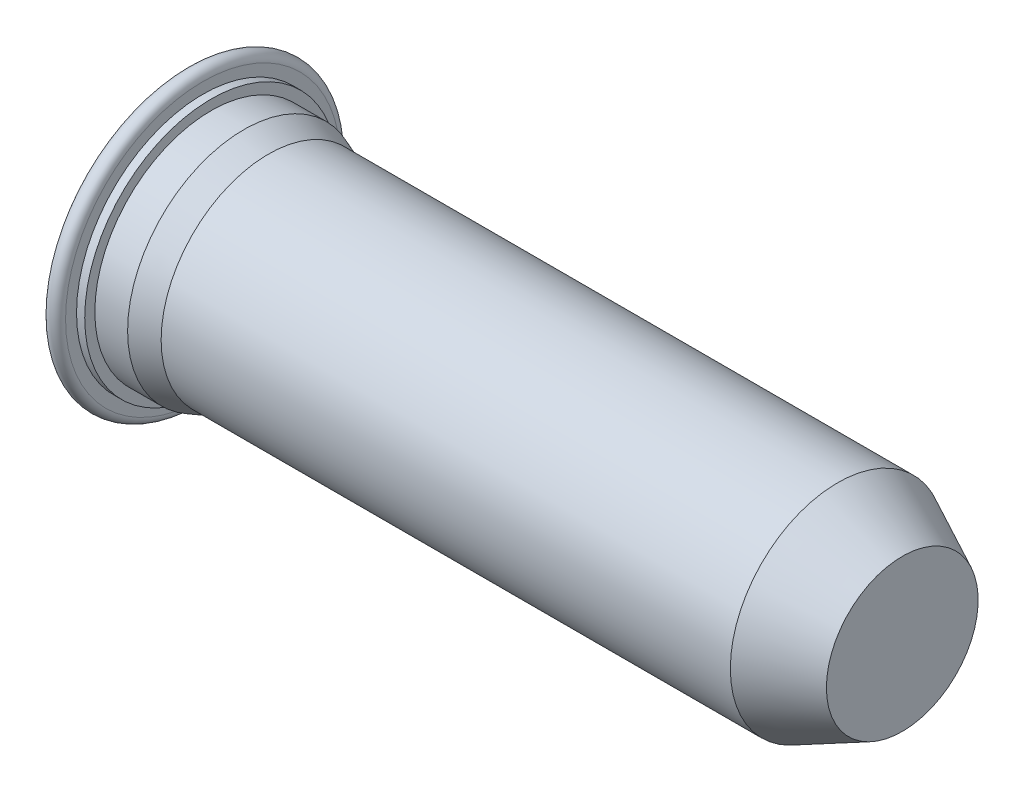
ISO-10303-21;
HEADER;
FILE_DESCRIPTION(('STEP AP214'),'2;1');
FILE_NAME('part.step','',(''),(''),'','','');
FILE_SCHEMA(('AUTOMOTIVE_DESIGN { 1 0 10303 214 1 1 1 1 }'));
ENDSEC;
DATA;
#1=APPLICATION_CONTEXT('core data for automotive mechanical design processes');
#2=APPLICATION_PROTOCOL_DEFINITION('international standard','automotive_design',2000,#1);
#3=PRODUCT_CONTEXT('',#1,'mechanical');
#4=PRODUCT('Part','Part','',(#3));
#5=PRODUCT_RELATED_PRODUCT_CATEGORY('part','',(#4));
#6=PRODUCT_DEFINITION_FORMATION('','',#4);
#7=PRODUCT_DEFINITION_CONTEXT('part definition',#1,'design');
#8=PRODUCT_DEFINITION('design','',#6,#7);
#9=PRODUCT_DEFINITION_SHAPE('','',#8);
#10=(LENGTH_UNIT() NAMED_UNIT(*) SI_UNIT(.MILLI.,.METRE.));
#11=(NAMED_UNIT(*) PLANE_ANGLE_UNIT() SI_UNIT($,.RADIAN.));
#12=(NAMED_UNIT(*) SI_UNIT($,.STERADIAN.) SOLID_ANGLE_UNIT());
#13=UNCERTAINTY_MEASURE_WITH_UNIT(LENGTH_MEASURE(1.E-05),#10,'distance_accuracy_value','');
#14=(GEOMETRIC_REPRESENTATION_CONTEXT(3) GLOBAL_UNCERTAINTY_ASSIGNED_CONTEXT((#13)) GLOBAL_UNIT_ASSIGNED_CONTEXT((#10,
#11,#12)) REPRESENTATION_CONTEXT('',''));
#15=CARTESIAN_POINT('',(0.,0.,0.));
#16=DIRECTION('',(0.,0.,1.));
#17=DIRECTION('',(1.,0.,0.));
#18=AXIS2_PLACEMENT_3D('',#15,#16,#17);
#19=CARTESIAN_POINT('',(0.,0.,0.));
#20=DIRECTION('',(-1.,0.,0.));
#21=DIRECTION('',(0.,0.,1.));
#22=AXIS2_PLACEMENT_3D('',#19,#20,#21);
#23=PLANE('',#22);
#24=CARTESIAN_POINT('',(0.,0.,0.));
#25=DIRECTION('',(-1.,0.,0.));
#26=DIRECTION('',(0.,0.,1.));
#27=AXIS2_PLACEMENT_3D('',#24,#25,#26);
#28=CIRCLE('',#27,3.83346);
#29=CARTESIAN_POINT('',(0.,0.,3.83346));
#30=VERTEX_POINT('',#29);
#31=EDGE_CURVE('E10',#30,#30,#28,.T.);
#32=ORIENTED_EDGE('',*,*,#31,.T.);
#33=EDGE_LOOP('',(#32));
#34=FACE_BOUND('',#33,.T.);
#35=ADVANCED_FACE('F40',(#34),#23,.T.);
#36=CARTESIAN_POINT('',(0.,0.,0.));
#37=DIRECTION('',(-1.,0.,0.));
#38=DIRECTION('',(0.,0.,1.));
#39=AXIS2_PLACEMENT_3D('',#36,#37,#38);
#40=CYLINDRICAL_SURFACE('',#39,3.83346);
#41=CARTESIAN_POINT('',(0.00508000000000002,0.,0.));
#42=DIRECTION('',(-1.,0.,0.));
#43=DIRECTION('',(0.,0.,1.));
#44=AXIS2_PLACEMENT_3D('',#41,#42,#43);
#45=CIRCLE('',#44,3.83346);
#46=CARTESIAN_POINT('',(0.00508000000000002,0.,3.83346));
#47=VERTEX_POINT('',#46);
#48=EDGE_CURVE('E43',#47,#47,#45,.T.);
#49=ORIENTED_EDGE('',*,*,#48,.T.);
#50=EDGE_LOOP('',(#49));
#51=FACE_BOUND('',#50,.T.);
#52=ORIENTED_EDGE('',*,*,#31,.F.);
#53=EDGE_LOOP('',(#52));
#54=FACE_BOUND('',#53,.T.);
#55=ADVANCED_FACE('F86',(#51,#54),#40,.T.);
#56=CARTESIAN_POINT('',(0.00508000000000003,3.83854,0.));
#57=DIRECTION('',(1.,0.,0.));
#58=DIRECTION('',(0.,0.,-1.));
#59=AXIS2_PLACEMENT_3D('',#56,#57,#58);
#60=PLANE('',#59);
#61=ORIENTED_EDGE('',*,*,#48,.F.);
#62=EDGE_LOOP('',(#61));
#63=FACE_BOUND('',#62,.T.);
#64=CARTESIAN_POINT('',(0.00508000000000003,0.,0.));
#65=DIRECTION('',(-1.,0.,0.));
#66=DIRECTION('',(0.,0.,1.));
#67=AXIS2_PLACEMENT_3D('',#64,#65,#66);
#68=CIRCLE('',#67,3.83854);
#69=CARTESIAN_POINT('',(0.00508000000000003,0.,3.83854));
#70=VERTEX_POINT('',#69);
#71=EDGE_CURVE('E50',#70,#70,#68,.T.);
#72=ORIENTED_EDGE('',*,*,#71,.T.);
#73=EDGE_LOOP('',(#72));
#74=FACE_BOUND('',#73,.T.);
#75=ADVANCED_FACE('F94',(#63,#74),#60,.F.);
#76=CARTESIAN_POINT('',(0.23154,0.,0.));
#77=DIRECTION('',(-1.,0.,0.));
#78=DIRECTION('',(0.,0.,1.));
#79=AXIS2_PLACEMENT_3D('',#76,#77,#78);
#80=TOROIDAL_SURFACE('',#79,3.83854,0.22646);
#81=CARTESIAN_POINT('',(0.458,0.,0.));
#82=DIRECTION('',(-1.,0.,0.));
#83=DIRECTION('',(0.,0.,1.));
#84=AXIS2_PLACEMENT_3D('',#81,#82,#83);
#85=CIRCLE('',#84,3.83854);
#86=CARTESIAN_POINT('',(0.458,0.,3.83854));
#87=VERTEX_POINT('',#86);
#88=EDGE_CURVE('E51',#87,#87,#85,.T.);
#89=ORIENTED_EDGE('',*,*,#88,.T.);
#90=EDGE_LOOP('',(#89));
#91=FACE_BOUND('',#90,.T.);
#92=ORIENTED_EDGE('',*,*,#71,.F.);
#93=EDGE_LOOP('',(#92));
#94=FACE_BOUND('',#93,.T.);
#95=ADVANCED_FACE('F96',(#91,#94),#80,.T.);
#96=CARTESIAN_POINT('',(0.458,3.83854,0.));
#97=DIRECTION('',(1.,0.,0.));
#98=DIRECTION('',(0.,0.,-1.));
#99=AXIS2_PLACEMENT_3D('',#96,#97,#98);
#100=PLANE('',#99);
#101=CARTESIAN_POINT('',(0.458,0.,0.));
#102=DIRECTION('',(-1.,0.,0.));
#103=DIRECTION('',(0.,0.,1.));
#104=AXIS2_PLACEMENT_3D('',#101,#102,#103);
#105=CIRCLE('',#104,3.5325);
#106=CARTESIAN_POINT('',(0.458,0.,3.5325));
#107=VERTEX_POINT('',#106);
#108=EDGE_CURVE('E57',#107,#107,#105,.T.);
#109=ORIENTED_EDGE('',*,*,#108,.T.);
#110=EDGE_LOOP('',(#109));
#111=FACE_BOUND('',#110,.T.);
#112=ORIENTED_EDGE('',*,*,#88,.F.);
#113=EDGE_LOOP('',(#112));
#114=FACE_BOUND('',#113,.T.);
#115=ADVANCED_FACE('F102',(#111,#114),#100,.T.);
#116=CARTESIAN_POINT('',(0.,0.,0.));
#117=DIRECTION('',(-1.,0.,0.));
#118=DIRECTION('',(0.,0.,1.));
#119=AXIS2_PLACEMENT_3D('',#116,#117,#118);
#120=CYLINDRICAL_SURFACE('',#119,3.5325);
#121=CARTESIAN_POINT('',(0.687,0.,0.));
#122=DIRECTION('',(-1.,0.,0.));
#123=DIRECTION('',(0.,0.,1.));
#124=AXIS2_PLACEMENT_3D('',#121,#122,#123);
#125=CIRCLE('',#124,3.5325);
#126=CARTESIAN_POINT('',(0.687,0.,3.5325));
#127=VERTEX_POINT('',#126);
#128=EDGE_CURVE('E56',#127,#127,#125,.T.);
#129=ORIENTED_EDGE('',*,*,#128,.T.);
#130=EDGE_LOOP('',(#129));
#131=FACE_BOUND('',#130,.T.);
#132=ORIENTED_EDGE('',*,*,#108,.F.);
#133=EDGE_LOOP('',(#132));
#134=FACE_BOUND('',#133,.T.);
#135=ADVANCED_FACE('F107',(#131,#134),#120,.T.);
#136=CARTESIAN_POINT('',(0.687,3.5325,0.));
#137=DIRECTION('',(1.,0.,0.));
#138=DIRECTION('',(0.,0.,-1.));
#139=AXIS2_PLACEMENT_3D('',#136,#137,#138);
#140=PLANE('',#139);
#141=CARTESIAN_POINT('',(0.687,0.,0.));
#142=DIRECTION('',(-1.,0.,0.));
#143=DIRECTION('',(0.,0.,1.));
#144=AXIS2_PLACEMENT_3D('',#141,#142,#143);
#145=CIRCLE('',#144,3.25);
#146=CARTESIAN_POINT('',(0.687,0.,3.25));
#147=VERTEX_POINT('',#146);
#148=EDGE_CURVE('E65',#147,#147,#145,.T.);
#149=ORIENTED_EDGE('',*,*,#148,.T.);
#150=EDGE_LOOP('',(#149));
#151=FACE_BOUND('',#150,.T.);
#152=ORIENTED_EDGE('',*,*,#128,.F.);
#153=EDGE_LOOP('',(#152));
#154=FACE_BOUND('',#153,.T.);
#155=ADVANCED_FACE('F113',(#151,#154),#140,.T.);
#156=CARTESIAN_POINT('',(0.,0.,0.));
#157=DIRECTION('',(-1.,0.,0.));
#158=DIRECTION('',(0.,0.,1.));
#159=AXIS2_PLACEMENT_3D('',#156,#157,#158);
#160=CYLINDRICAL_SURFACE('',#159,3.25);
#161=ORIENTED_EDGE('',*,*,#148,.F.);
#162=EDGE_LOOP('',(#161));
#163=FACE_BOUND('',#162,.T.);
#164=CARTESIAN_POINT('',(1.60313064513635,0.,0.));
#165=DIRECTION('',(-1.,0.,0.));
#166=DIRECTION('',(0.,0.,1.));
#167=AXIS2_PLACEMENT_3D('',#164,#165,#166);
#168=CIRCLE('',#167,3.25);
#169=CARTESIAN_POINT('',(1.60313064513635,0.,3.25));
#170=VERTEX_POINT('',#169);
#171=EDGE_CURVE('E63',#170,#170,#168,.T.);
#172=ORIENTED_EDGE('',*,*,#171,.T.);
#173=EDGE_LOOP('',(#172));
#174=FACE_BOUND('',#173,.T.);
#175=ADVANCED_FACE('F120',(#163,#174),#160,.T.);
#176=CARTESIAN_POINT('',(2.29,0.,0.));
#177=DIRECTION('',(-1.,0.,0.));
#178=DIRECTION('',(0.,0.,1.));
#179=AXIS2_PLACEMENT_3D('',#176,#177,#178);
#180=CONICAL_SURFACE('',#179,3.,0.349065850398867);
#181=ORIENTED_EDGE('',*,*,#171,.F.);
#182=EDGE_LOOP('',(#181));
#183=FACE_BOUND('',#182,.T.);
#184=CARTESIAN_POINT('',(2.29,0.,0.));
#185=DIRECTION('',(-1.,0.,0.));
#186=DIRECTION('',(0.,0.,1.));
#187=AXIS2_PLACEMENT_3D('',#184,#185,#186);
#188=CIRCLE('',#187,3.);
#189=CARTESIAN_POINT('',(2.29,0.,3.));
#190=VERTEX_POINT('',#189);
#191=EDGE_CURVE('E67',#190,#190,#188,.T.);
#192=ORIENTED_EDGE('',*,*,#191,.T.);
#193=EDGE_LOOP('',(#192));
#194=FACE_BOUND('',#193,.T.);
#195=ADVANCED_FACE('F122',(#183,#194),#180,.T.);
#196=CARTESIAN_POINT('',(0.,0.,0.));
#197=DIRECTION('',(-1.,0.,0.));
#198=DIRECTION('',(0.,0.,1.));
#199=AXIS2_PLACEMENT_3D('',#196,#197,#198);
#200=CYLINDRICAL_SURFACE('',#199,3.);
#201=CARTESIAN_POINT('',(18.1957326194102,0.,0.));
#202=DIRECTION('',(-1.,0.,0.));
#203=DIRECTION('',(0.,0.,1.));
#204=AXIS2_PLACEMENT_3D('',#201,#202,#203);
#205=CIRCLE('',#204,3.);
#206=CARTESIAN_POINT('',(18.1957326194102,0.,3.));
#207=VERTEX_POINT('',#206);
#208=EDGE_CURVE('E72',#207,#207,#205,.T.);
#209=ORIENTED_EDGE('',*,*,#208,.T.);
#210=EDGE_LOOP('',(#209));
#211=FACE_BOUND('',#210,.T.);
#212=ORIENTED_EDGE('',*,*,#191,.F.);
#213=EDGE_LOOP('',(#212));
#214=FACE_BOUND('',#213,.T.);
#215=ADVANCED_FACE('F88',(#211,#214),#200,.T.);
#216=CARTESIAN_POINT('',(20.,0.,0.));
#217=DIRECTION('',(-1.,0.,0.));
#218=DIRECTION('',(0.,0.,1.));
#219=AXIS2_PLACEMENT_3D('',#216,#217,#218);
#220=CONICAL_SURFACE('',#219,2.12,0.45378560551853);
#221=ORIENTED_EDGE('',*,*,#208,.F.);
#222=EDGE_LOOP('',(#221));
#223=FACE_BOUND('',#222,.T.);
#224=CARTESIAN_POINT('',(20.,0.,0.));
#225=DIRECTION('',(-1.,0.,0.));
#226=DIRECTION('',(0.,0.,1.));
#227=AXIS2_PLACEMENT_3D('',#224,#225,#226);
#228=CIRCLE('',#227,2.12);
#229=CARTESIAN_POINT('',(20.,0.,2.12));
#230=VERTEX_POINT('',#229);
#231=EDGE_CURVE('E74',#230,#230,#228,.T.);
#232=ORIENTED_EDGE('',*,*,#231,.T.);
#233=EDGE_LOOP('',(#232));
#234=FACE_BOUND('',#233,.T.);
#235=ADVANCED_FACE('F76',(#223,#234),#220,.T.);
#236=CARTESIAN_POINT('',(20.,2.12,0.));
#237=DIRECTION('',(1.,0.,0.));
#238=DIRECTION('',(0.,0.,-1.));
#239=AXIS2_PLACEMENT_3D('',#236,#237,#238);
#240=PLANE('',#239);
#241=ORIENTED_EDGE('',*,*,#231,.F.);
#242=EDGE_LOOP('',(#241));
#243=FACE_BOUND('',#242,.T.);
#244=ADVANCED_FACE('F78',(#243),#240,.T.);
#245=CLOSED_SHELL('',(#35,#55,#75,#95,#115,#135,#155,#175,#195,#215,#235,#244));
#246=MANIFOLD_SOLID_BREP('B2',#245);
#247=ADVANCED_BREP_SHAPE_REPRESENTATION('',(#18,#246),#14);
#248=SHAPE_DEFINITION_REPRESENTATION(#9,#247);
ENDSEC;
END-ISO-10303-21;
